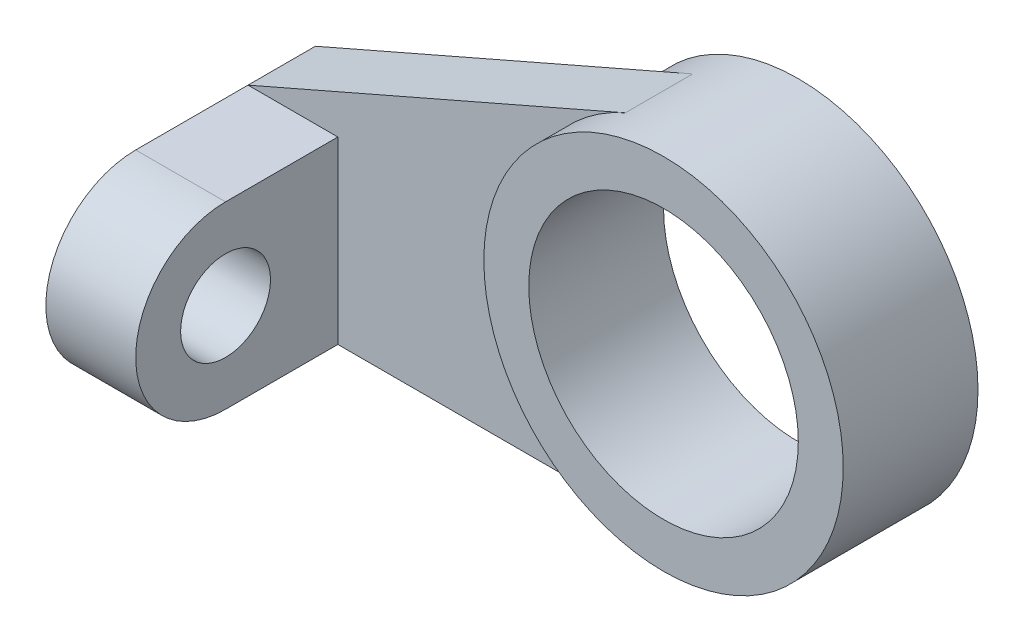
ISO-10303-21;
HEADER;
FILE_DESCRIPTION(('STEP AP214'),'2;1');
FILE_NAME('part.step','',(''),(''),'','','');
FILE_SCHEMA(('AUTOMOTIVE_DESIGN { 1 0 10303 214 1 1 1 1 }'));
ENDSEC;
DATA;
#1=APPLICATION_CONTEXT('core data for automotive mechanical design processes');
#2=APPLICATION_PROTOCOL_DEFINITION('international standard','automotive_design',2000,#1);
#3=PRODUCT_CONTEXT('',#1,'mechanical');
#4=PRODUCT('Part','Part','',(#3));
#5=PRODUCT_RELATED_PRODUCT_CATEGORY('part','',(#4));
#6=PRODUCT_DEFINITION_FORMATION('','',#4);
#7=PRODUCT_DEFINITION_CONTEXT('part definition',#1,'design');
#8=PRODUCT_DEFINITION('design','',#6,#7);
#9=PRODUCT_DEFINITION_SHAPE('','',#8);
#10=(LENGTH_UNIT() NAMED_UNIT(*) SI_UNIT(.MILLI.,.METRE.));
#11=(NAMED_UNIT(*) PLANE_ANGLE_UNIT() SI_UNIT($,.RADIAN.));
#12=(NAMED_UNIT(*) SI_UNIT($,.STERADIAN.) SOLID_ANGLE_UNIT());
#13=UNCERTAINTY_MEASURE_WITH_UNIT(LENGTH_MEASURE(1.E-05),#10,'distance_accuracy_value','');
#14=(GEOMETRIC_REPRESENTATION_CONTEXT(3) GLOBAL_UNCERTAINTY_ASSIGNED_CONTEXT((#13)) GLOBAL_UNIT_ASSIGNED_CONTEXT((#10,
#11,#12)) REPRESENTATION_CONTEXT('',''));
#15=CARTESIAN_POINT('',(0.,0.,0.));
#16=DIRECTION('',(0.,0.,1.));
#17=DIRECTION('',(1.,0.,0.));
#18=AXIS2_PLACEMENT_3D('',#15,#16,#17);
#19=CARTESIAN_POINT('',(0.,0.,19.05));
#20=DIRECTION('',(0.,0.,1.));
#21=DIRECTION('',(1.,0.,0.));
#22=AXIS2_PLACEMENT_3D('',#19,#20,#21);
#23=PLANE('',#22);
#24=CARTESIAN_POINT('',(0.,0.,19.05));
#25=DIRECTION('',(0.,0.,1.));
#26=DIRECTION('',(1.,0.,0.));
#27=AXIS2_PLACEMENT_3D('',#24,#25,#26);
#28=CIRCLE('',#27,50.8);
#29=CARTESIAN_POINT('',(50.8,0.,19.05));
#30=VERTEX_POINT('',#29);
#31=EDGE_CURVE('E12',#30,#30,#28,.T.);
#32=ORIENTED_EDGE('',*,*,#31,.T.);
#33=EDGE_LOOP('',(#32));
#34=FACE_BOUND('',#33,.T.);
#35=CARTESIAN_POINT('',(0.,0.,19.05));
#36=DIRECTION('',(0.,0.,1.));
#37=DIRECTION('',(1.,0.,0.));
#38=AXIS2_PLACEMENT_3D('',#35,#36,#37);
#39=CIRCLE('',#38,38.1);
#40=CARTESIAN_POINT('',(-38.1,0.,19.05));
#41=VERTEX_POINT('',#40);
#42=EDGE_CURVE('E158',#41,#41,#39,.T.);
#43=ORIENTED_EDGE('',*,*,#42,.F.);
#44=EDGE_LOOP('',(#43));
#45=FACE_BOUND('',#44,.T.);
#46=ADVANCED_FACE('F43',(#34,#45),#23,.T.);
#47=CARTESIAN_POINT('',(0.,0.,-19.05));
#48=DIRECTION('',(0.,0.,1.));
#49=DIRECTION('',(1.,0.,0.));
#50=AXIS2_PLACEMENT_3D('',#47,#48,#49);
#51=PLANE('',#50);
#52=CARTESIAN_POINT('',(0.,0.,-19.05));
#53=DIRECTION('',(0.,0.,1.));
#54=DIRECTION('',(1.,0.,0.));
#55=AXIS2_PLACEMENT_3D('',#52,#53,#54);
#56=CIRCLE('',#55,50.8);
#57=CARTESIAN_POINT('',(50.8,0.,-19.05));
#58=VERTEX_POINT('',#57);
#59=EDGE_CURVE('E47',#58,#58,#56,.T.);
#60=ORIENTED_EDGE('',*,*,#59,.F.);
#61=EDGE_LOOP('',(#60));
#62=FACE_BOUND('',#61,.T.);
#63=CARTESIAN_POINT('',(0.,0.,-19.05));
#64=DIRECTION('',(0.,0.,1.));
#65=DIRECTION('',(1.,0.,0.));
#66=AXIS2_PLACEMENT_3D('',#63,#64,#65);
#67=CIRCLE('',#66,38.1);
#68=CARTESIAN_POINT('',(-38.1,0.,-19.05));
#69=VERTEX_POINT('',#68);
#70=EDGE_CURVE('E157',#69,#69,#67,.T.);
#71=ORIENTED_EDGE('',*,*,#70,.T.);
#72=EDGE_LOOP('',(#71));
#73=FACE_BOUND('',#72,.T.);
#74=ADVANCED_FACE('F164',(#62,#73),#51,.F.);
#75=CARTESIAN_POINT('',(0.,0.,19.05));
#76=DIRECTION('',(0.,0.,-1.));
#77=DIRECTION('',(-1.,0.,0.));
#78=AXIS2_PLACEMENT_3D('',#75,#76,#77);
#79=CYLINDRICAL_SURFACE('',#78,50.8);
#80=DIRECTION('',(0.,0.,-1.));
#81=VECTOR('',#80,1.);
#82=CARTESIAN_POINT('',(-20.32,46.5589690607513,9.525));
#83=LINE('',#82,#81);
#84=CARTESIAN_POINT('',(-20.32,46.5589690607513,9.525));
#85=VERTEX_POINT('',#84);
#86=CARTESIAN_POINT('',(-20.32,46.5589690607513,-9.525));
#87=VERTEX_POINT('',#86);
#88=EDGE_CURVE('E154',#85,#87,#83,.T.);
#89=ORIENTED_EDGE('',*,*,#88,.F.);
#90=CARTESIAN_POINT('',(0.,0.,9.525));
#91=DIRECTION('',(0.,0.,-1.));
#92=DIRECTION('',(1.,0.,0.));
#93=AXIS2_PLACEMENT_3D('',#90,#91,#92);
#94=CIRCLE('',#93,50.8);
#95=CARTESIAN_POINT('',(0.,-50.8,9.525));
#96=VERTEX_POINT('',#95);
#97=EDGE_CURVE('E134',#96,#85,#94,.T.);
#98=ORIENTED_EDGE('',*,*,#97,.F.);
#99=DIRECTION('',(0.,0.,-1.));
#100=VECTOR('',#99,1.);
#101=CARTESIAN_POINT('',(0.,-50.8,9.525));
#102=LINE('',#101,#100);
#103=CARTESIAN_POINT('',(0.,-50.8,-9.525));
#104=VERTEX_POINT('',#103);
#105=EDGE_CURVE('E141',#96,#104,#102,.T.);
#106=ORIENTED_EDGE('',*,*,#105,.T.);
#107=CARTESIAN_POINT('',(0.,0.,-9.525));
#108=DIRECTION('',(0.,0.,-1.));
#109=DIRECTION('',(1.,0.,0.));
#110=AXIS2_PLACEMENT_3D('',#107,#108,#109);
#111=CIRCLE('',#110,50.8);
#112=EDGE_CURVE('E132',#104,#87,#111,.T.);
#113=ORIENTED_EDGE('',*,*,#112,.T.);
#114=EDGE_LOOP('',(#89,#98,#106,#113));
#115=FACE_BOUND('',#114,.T.);
#116=ORIENTED_EDGE('',*,*,#31,.F.);
#117=EDGE_LOOP('',(#116));
#118=FACE_BOUND('',#117,.T.);
#119=ORIENTED_EDGE('',*,*,#59,.T.);
#120=EDGE_LOOP('',(#119));
#121=FACE_BOUND('',#120,.T.);
#122=ADVANCED_FACE('F45',(#115,#118,#121),#79,.T.);
#123=CARTESIAN_POINT('',(0.,0.,19.05));
#124=DIRECTION('',(0.,0.,-1.));
#125=DIRECTION('',(-1.,0.,0.));
#126=AXIS2_PLACEMENT_3D('',#123,#124,#125);
#127=CYLINDRICAL_SURFACE('',#126,38.1);
#128=CARTESIAN_POINT('',(-38.1,0.,19.05));
#129=CARTESIAN_POINT('',(-38.1,0.,18.653125));
#130=CARTESIAN_POINT('',(-38.1,0.,18.25625));
#131=CARTESIAN_POINT('',(-38.1,0.,17.4625));
#132=CARTESIAN_POINT('',(-38.1,0.,17.065625));
#133=CARTESIAN_POINT('',(-38.1,0.,16.271875));
#134=CARTESIAN_POINT('',(-38.1,0.,15.875));
#135=CARTESIAN_POINT('',(-38.1,0.,15.08125));
#136=CARTESIAN_POINT('',(-38.1,0.,14.684375));
#137=CARTESIAN_POINT('',(-38.1,0.,13.890625));
#138=CARTESIAN_POINT('',(-38.1,0.,13.49375));
#139=CARTESIAN_POINT('',(-38.1,0.,12.7));
#140=CARTESIAN_POINT('',(-38.1,0.,12.303125));
#141=CARTESIAN_POINT('',(-38.1,0.,11.509375));
#142=CARTESIAN_POINT('',(-38.1,0.,11.1125));
#143=CARTESIAN_POINT('',(-38.1,0.,10.31875));
#144=CARTESIAN_POINT('',(-38.1,0.,9.921875));
#145=CARTESIAN_POINT('',(-38.1,0.,9.128125));
#146=CARTESIAN_POINT('',(-38.1,0.,8.73125));
#147=CARTESIAN_POINT('',(-38.1,0.,7.9375));
#148=CARTESIAN_POINT('',(-38.1,0.,7.540625));
#149=CARTESIAN_POINT('',(-38.1,0.,6.746875));
#150=CARTESIAN_POINT('',(-38.1,0.,6.35));
#151=CARTESIAN_POINT('',(-38.1,0.,5.55625));
#152=CARTESIAN_POINT('',(-38.1,0.,5.159375));
#153=CARTESIAN_POINT('',(-38.1,0.,4.365625));
#154=CARTESIAN_POINT('',(-38.1,0.,3.96875));
#155=CARTESIAN_POINT('',(-38.1,0.,3.175));
#156=CARTESIAN_POINT('',(-38.1,0.,2.778125));
#157=CARTESIAN_POINT('',(-38.1,0.,1.984375));
#158=CARTESIAN_POINT('',(-38.1,0.,1.5875));
#159=CARTESIAN_POINT('',(-38.1,0.,0.79375));
#160=CARTESIAN_POINT('',(-38.1,0.,0.396875));
#161=CARTESIAN_POINT('',(-38.1,0.,-0.396875));
#162=CARTESIAN_POINT('',(-38.1,0.,-0.79375));
#163=CARTESIAN_POINT('',(-38.1,0.,-1.5875));
#164=CARTESIAN_POINT('',(-38.1,0.,-1.984375));
#165=CARTESIAN_POINT('',(-38.1,0.,-2.778125));
#166=CARTESIAN_POINT('',(-38.1,0.,-3.175));
#167=CARTESIAN_POINT('',(-38.1,0.,-3.96875));
#168=CARTESIAN_POINT('',(-38.1,0.,-4.365625));
#169=CARTESIAN_POINT('',(-38.1,0.,-5.159375));
#170=CARTESIAN_POINT('',(-38.1,0.,-5.55625));
#171=CARTESIAN_POINT('',(-38.1,0.,-6.35));
#172=CARTESIAN_POINT('',(-38.1,0.,-6.746875));
#173=CARTESIAN_POINT('',(-38.1,0.,-7.540625));
#174=CARTESIAN_POINT('',(-38.1,0.,-7.9375));
#175=CARTESIAN_POINT('',(-38.1,0.,-8.73125));
#176=CARTESIAN_POINT('',(-38.1,0.,-9.128125));
#177=CARTESIAN_POINT('',(-38.1,0.,-9.921875));
#178=CARTESIAN_POINT('',(-38.1,0.,-10.31875));
#179=CARTESIAN_POINT('',(-38.1,0.,-11.1125));
#180=CARTESIAN_POINT('',(-38.1,0.,-11.509375));
#181=CARTESIAN_POINT('',(-38.1,0.,-12.303125));
#182=CARTESIAN_POINT('',(-38.1,0.,-12.7));
#183=CARTESIAN_POINT('',(-38.1,0.,-13.49375));
#184=CARTESIAN_POINT('',(-38.1,0.,-13.890625));
#185=CARTESIAN_POINT('',(-38.1,0.,-14.684375));
#186=CARTESIAN_POINT('',(-38.1,0.,-15.08125));
#187=CARTESIAN_POINT('',(-38.1,0.,-15.875));
#188=CARTESIAN_POINT('',(-38.1,0.,-16.271875));
#189=CARTESIAN_POINT('',(-38.1,0.,-17.065625));
#190=CARTESIAN_POINT('',(-38.1,0.,-17.4625));
#191=CARTESIAN_POINT('',(-38.1,0.,-18.25625));
#192=CARTESIAN_POINT('',(-38.1,0.,-18.653125));
#193=CARTESIAN_POINT('',(-38.1,0.,-19.05));
#194=B_SPLINE_CURVE_WITH_KNOTS('',3,(#128,#129,#130,#131,#132,#133,#134,#135,#136,#137,#138,
#139,#140,#141,#142,#143,#144,#145,#146,#147,#148,#149,#150,#151,#152,#153,#154,#155,#156,#157,
#158,#159,#160,#161,#162,#163,#164,#165,#166,#167,#168,#169,#170,#171,#172,#173,#174,#175,#176,
#177,#178,#179,#180,#181,#182,#183,#184,#185,#186,#187,#188,#189,#190,#191,#192,#193),
.UNSPECIFIED.,.F.,.F.,(4,2,2,2,2,2,2,2,2,2,2,2,2,2,2,2,2,2,2,2,2,2,2,2,2,2,2,2,2,2,2,2,4),(0.,
1.190625,2.38125,3.571875,4.7625,5.953125,7.14375,8.334375,9.525,10.715625,11.90625,13.096875,
14.2875,15.478125,16.66875,17.859375,19.05,20.240625,21.43125,22.621875,23.8125,25.003125,
26.19375,27.384375,28.575,29.765625,30.95625,32.146875,33.3375,34.528125,35.71875,36.909375,
38.1),.UNSPECIFIED.);
#195=EDGE_CURVE('BSEAM166',#41,#69,#194,.T.);
#196=ORIENTED_EDGE('',*,*,#42,.T.);
#197=ORIENTED_EDGE('',*,*,#70,.F.);
#198=ORIENTED_EDGE('',*,*,#195,.T.);
#199=ORIENTED_EDGE('',*,*,#195,.F.);
#200=EDGE_LOOP('',(#196,#198,#197,#199));
#201=FACE_BOUND('',#200,.T.);
#202=ADVANCED_FACE('F166',(#201),#127,.F.);
#203=CARTESIAN_POINT('',(-127.,0.,9.525));
#204=DIRECTION('',(0.4,-0.916515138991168,0.));
#205=DIRECTION('',(0.916515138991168,0.4,0.));
#206=AXIS2_PLACEMENT_3D('',#203,#204,#205);
#207=PLANE('',#206);
#208=DIRECTION('',(-0.916515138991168,-0.4,0.));
#209=VECTOR('',#208,1.);
#210=CARTESIAN_POINT('',(-127.,0.,-9.525));
#211=LINE('',#210,#209);
#212=CARTESIAN_POINT('',(-127.,0.,-9.525));
#213=VERTEX_POINT('',#212);
#214=EDGE_CURVE('E143',#87,#213,#211,.T.);
#215=ORIENTED_EDGE('',*,*,#214,.T.);
#216=DIRECTION('',(0.,0.,-1.));
#217=VECTOR('',#216,1.);
#218=CARTESIAN_POINT('',(-127.,0.,9.525));
#219=LINE('',#218,#217);
#220=CARTESIAN_POINT('',(-127.,0.,9.525));
#221=VERTEX_POINT('',#220);
#222=EDGE_CURVE('E151',#221,#213,#219,.T.);
#223=ORIENTED_EDGE('',*,*,#222,.F.);
#224=DIRECTION('',(-0.916515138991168,-0.4,0.));
#225=VECTOR('',#224,1.);
#226=CARTESIAN_POINT('',(-127.,0.,9.525));
#227=LINE('',#226,#225);
#228=EDGE_CURVE('E137',#85,#221,#227,.T.);
#229=ORIENTED_EDGE('',*,*,#228,.F.);
#230=ORIENTED_EDGE('',*,*,#88,.T.);
#231=EDGE_LOOP('',(#215,#223,#229,#230));
#232=FACE_BOUND('',#231,.T.);
#233=ADVANCED_FACE('F168',(#232),#207,.F.);
#234=CARTESIAN_POINT('',(-127.,-50.8,9.525));
#235=DIRECTION('',(1.,0.,0.));
#236=DIRECTION('',(0.,0.,-1.));
#237=AXIS2_PLACEMENT_3D('',#234,#235,#236);
#238=PLANE('',#237);
#239=DIRECTION('',(0.,-1.,0.));
#240=VECTOR('',#239,1.);
#241=CARTESIAN_POINT('',(-127.,-50.8,-9.525));
#242=LINE('',#241,#240);
#243=CARTESIAN_POINT('',(-127.,-50.8,-9.525));
#244=VERTEX_POINT('',#243);
#245=EDGE_CURVE('E145',#213,#244,#242,.T.);
#246=ORIENTED_EDGE('',*,*,#245,.T.);
#247=DIRECTION('',(0.,0.,-1.));
#248=VECTOR('',#247,1.);
#249=CARTESIAN_POINT('',(-127.,-50.8,9.525));
#250=LINE('',#249,#248);
#251=CARTESIAN_POINT('',(-127.,-50.8,41.275));
#252=VERTEX_POINT('',#251);
#253=EDGE_CURVE('E149',#252,#244,#250,.T.);
#254=ORIENTED_EDGE('',*,*,#253,.F.);
#255=CARTESIAN_POINT('',(-127.,-25.4,41.275));
#256=DIRECTION('',(-1.,0.,0.));
#257=DIRECTION('',(0.,0.,1.));
#258=AXIS2_PLACEMENT_3D('',#255,#256,#257);
#259=CIRCLE('',#258,25.4);
#260=CARTESIAN_POINT('',(-127.,0.,41.275));
#261=VERTEX_POINT('',#260);
#262=EDGE_CURVE('E104',#252,#261,#259,.T.);
#263=ORIENTED_EDGE('',*,*,#262,.T.);
#264=DIRECTION('',(0.,0.,-1.));
#265=VECTOR('',#264,1.);
#266=CARTESIAN_POINT('',(-127.,0.,9.525));
#267=LINE('',#266,#265);
#268=EDGE_CURVE('E122',#261,#221,#267,.T.);
#269=ORIENTED_EDGE('',*,*,#268,.T.);
#270=ORIENTED_EDGE('',*,*,#222,.T.);
#271=EDGE_LOOP('',(#246,#254,#263,#269,#270));
#272=FACE_BOUND('',#271,.T.);
#273=CARTESIAN_POINT('',(-127.,-25.4,41.275));
#274=DIRECTION('',(-1.,0.,0.));
#275=DIRECTION('',(0.,0.,1.));
#276=AXIS2_PLACEMENT_3D('',#273,#274,#275);
#277=CIRCLE('',#276,12.7);
#278=CARTESIAN_POINT('',(-127.,-25.4,53.975));
#279=VERTEX_POINT('',#278);
#280=EDGE_CURVE('E291',#279,#279,#277,.T.);
#281=ORIENTED_EDGE('',*,*,#280,.F.);
#282=EDGE_LOOP('',(#281));
#283=FACE_BOUND('',#282,.T.);
#284=ADVANCED_FACE('F175',(#272,#283),#238,.F.);
#285=CARTESIAN_POINT('',(0.,-50.8,9.525));
#286=DIRECTION('',(0.,1.,0.));
#287=DIRECTION('',(-1.,0.,0.));
#288=AXIS2_PLACEMENT_3D('',#285,#286,#287);
#289=PLANE('',#288);
#290=DIRECTION('',(1.,0.,0.));
#291=VECTOR('',#290,1.);
#292=CARTESIAN_POINT('',(0.,-50.8,-9.525));
#293=LINE('',#292,#291);
#294=EDGE_CURVE('E138',#244,#104,#293,.T.);
#295=ORIENTED_EDGE('',*,*,#294,.T.);
#296=ORIENTED_EDGE('',*,*,#105,.F.);
#297=DIRECTION('',(1.,0.,0.));
#298=VECTOR('',#297,1.);
#299=CARTESIAN_POINT('',(0.,-50.8,9.525));
#300=LINE('',#299,#298);
#301=CARTESIAN_POINT('',(-101.6,-50.8,9.525));
#302=VERTEX_POINT('',#301);
#303=EDGE_CURVE('E120',#302,#96,#300,.T.);
#304=ORIENTED_EDGE('',*,*,#303,.F.);
#305=DIRECTION('',(0.,0.,1.));
#306=VECTOR('',#305,1.);
#307=CARTESIAN_POINT('',(-101.6,-50.8,9.525));
#308=LINE('',#307,#306);
#309=CARTESIAN_POINT('',(-101.6,-50.8,41.275));
#310=VERTEX_POINT('',#309);
#311=EDGE_CURVE('E114',#302,#310,#308,.T.);
#312=ORIENTED_EDGE('',*,*,#311,.T.);
#313=DIRECTION('',(-1.,0.,0.));
#314=VECTOR('',#313,1.);
#315=CARTESIAN_POINT('',(-101.6,-50.8,41.275));
#316=LINE('',#315,#314);
#317=EDGE_CURVE('E98',#310,#252,#316,.T.);
#318=ORIENTED_EDGE('',*,*,#317,.T.);
#319=ORIENTED_EDGE('',*,*,#253,.T.);
#320=EDGE_LOOP('',(#295,#296,#304,#312,#318,#319));
#321=FACE_BOUND('',#320,.T.);
#322=ADVANCED_FACE('F118',(#321),#289,.F.);
#323=CARTESIAN_POINT('',(0.,0.,9.525));
#324=DIRECTION('',(0.,0.,1.));
#325=DIRECTION('',(1.,0.,0.));
#326=AXIS2_PLACEMENT_3D('',#323,#324,#325);
#327=PLANE('',#326);
#328=DIRECTION('',(-1.,0.,0.));
#329=VECTOR('',#328,1.);
#330=CARTESIAN_POINT('',(-101.6,0.,9.525));
#331=LINE('',#330,#329);
#332=CARTESIAN_POINT('',(-101.6,0.,9.525));
#333=VERTEX_POINT('',#332);
#334=EDGE_CURVE('E58',#333,#221,#331,.T.);
#335=ORIENTED_EDGE('',*,*,#334,.F.);
#336=DIRECTION('',(0.,-1.,0.));
#337=VECTOR('',#336,1.);
#338=CARTESIAN_POINT('',(-101.6,0.,9.525));
#339=LINE('',#338,#337);
#340=EDGE_CURVE('E62',#333,#302,#339,.T.);
#341=ORIENTED_EDGE('',*,*,#340,.T.);
#342=ORIENTED_EDGE('',*,*,#303,.T.);
#343=ORIENTED_EDGE('',*,*,#97,.T.);
#344=ORIENTED_EDGE('',*,*,#228,.T.);
#345=EDGE_LOOP('',(#335,#341,#342,#343,#344));
#346=FACE_BOUND('',#345,.T.);
#347=ADVANCED_FACE('F212',(#346),#327,.T.);
#348=CARTESIAN_POINT('',(0.,0.,-9.525));
#349=DIRECTION('',(0.,0.,1.));
#350=DIRECTION('',(1.,0.,0.));
#351=AXIS2_PLACEMENT_3D('',#348,#349,#350);
#352=PLANE('',#351);
#353=ORIENTED_EDGE('',*,*,#112,.F.);
#354=ORIENTED_EDGE('',*,*,#294,.F.);
#355=ORIENTED_EDGE('',*,*,#245,.F.);
#356=ORIENTED_EDGE('',*,*,#214,.F.);
#357=EDGE_LOOP('',(#353,#354,#355,#356));
#358=FACE_BOUND('',#357,.T.);
#359=ADVANCED_FACE('F206',(#358),#352,.F.);
#360=CARTESIAN_POINT('',(-101.6,0.,9.525));
#361=DIRECTION('',(0.,1.,0.));
#362=DIRECTION('',(0.,0.,1.));
#363=AXIS2_PLACEMENT_3D('',#360,#361,#362);
#364=PLANE('',#363);
#365=ORIENTED_EDGE('',*,*,#268,.F.);
#366=DIRECTION('',(-1.,0.,0.));
#367=VECTOR('',#366,1.);
#368=CARTESIAN_POINT('',(-101.6,0.,41.275));
#369=LINE('',#368,#367);
#370=CARTESIAN_POINT('',(-101.6,0.,41.275));
#371=VERTEX_POINT('',#370);
#372=EDGE_CURVE('E108',#371,#261,#369,.T.);
#373=ORIENTED_EDGE('',*,*,#372,.F.);
#374=DIRECTION('',(0.,0.,-1.));
#375=VECTOR('',#374,1.);
#376=CARTESIAN_POINT('',(-101.6,0.,9.525));
#377=LINE('',#376,#375);
#378=EDGE_CURVE('E109',#371,#333,#377,.T.);
#379=ORIENTED_EDGE('',*,*,#378,.T.);
#380=ORIENTED_EDGE('',*,*,#334,.T.);
#381=EDGE_LOOP('',(#365,#373,#379,#380));
#382=FACE_BOUND('',#381,.T.);
#383=ADVANCED_FACE('F211',(#382),#364,.T.);
#384=CARTESIAN_POINT('',(-101.6,-25.4,41.275));
#385=DIRECTION('',(-1.,0.,0.));
#386=DIRECTION('',(0.,0.,1.));
#387=AXIS2_PLACEMENT_3D('',#384,#385,#386);
#388=CYLINDRICAL_SURFACE('',#387,25.4);
#389=ORIENTED_EDGE('',*,*,#262,.F.);
#390=ORIENTED_EDGE('',*,*,#317,.F.);
#391=CARTESIAN_POINT('',(-101.6,-25.4,41.275));
#392=DIRECTION('',(-1.,0.,0.));
#393=DIRECTION('',(0.,0.,1.));
#394=AXIS2_PLACEMENT_3D('',#391,#392,#393);
#395=CIRCLE('',#394,25.4);
#396=EDGE_CURVE('E101',#310,#371,#395,.T.);
#397=ORIENTED_EDGE('',*,*,#396,.T.);
#398=ORIENTED_EDGE('',*,*,#372,.T.);
#399=EDGE_LOOP('',(#389,#390,#397,#398));
#400=FACE_BOUND('',#399,.T.);
#401=ADVANCED_FACE('F100',(#400),#388,.T.);
#402=CARTESIAN_POINT('',(-101.6,-25.4,41.275));
#403=DIRECTION('',(-1.,0.,0.));
#404=DIRECTION('',(0.,0.,1.));
#405=AXIS2_PLACEMENT_3D('',#402,#403,#404);
#406=PLANE('',#405);
#407=CARTESIAN_POINT('',(-101.6,-25.4,41.275));
#408=DIRECTION('',(-1.,0.,0.));
#409=DIRECTION('',(0.,0.,1.));
#410=AXIS2_PLACEMENT_3D('',#407,#408,#409);
#411=CIRCLE('',#410,12.7);
#412=CARTESIAN_POINT('',(-101.6,-25.4,53.975));
#413=VERTEX_POINT('',#412);
#414=EDGE_CURVE('E128',#413,#413,#411,.T.);
#415=ORIENTED_EDGE('',*,*,#414,.T.);
#416=EDGE_LOOP('',(#415));
#417=FACE_BOUND('',#416,.T.);
#418=ORIENTED_EDGE('',*,*,#340,.F.);
#419=ORIENTED_EDGE('',*,*,#378,.F.);
#420=ORIENTED_EDGE('',*,*,#396,.F.);
#421=ORIENTED_EDGE('',*,*,#311,.F.);
#422=EDGE_LOOP('',(#418,#419,#420,#421));
#423=FACE_BOUND('',#422,.T.);
#424=ADVANCED_FACE('F113',(#417,#423),#406,.F.);
#425=CARTESIAN_POINT('',(-101.6,-25.4,41.275));
#426=DIRECTION('',(-1.,0.,0.));
#427=DIRECTION('',(0.,0.,1.));
#428=AXIS2_PLACEMENT_3D('',#425,#426,#427);
#429=CYLINDRICAL_SURFACE('',#428,12.7);
#430=ORIENTED_EDGE('',*,*,#414,.F.);
#431=EDGE_LOOP('',(#430));
#432=FACE_BOUND('',#431,.T.);
#433=ORIENTED_EDGE('',*,*,#280,.T.);
#434=EDGE_LOOP('',(#433));
#435=FACE_BOUND('',#434,.T.);
#436=ADVANCED_FACE('F272',(#432,#435),#429,.F.);
#437=CLOSED_SHELL('',(#46,#74,#122,#202,#233,#284,#322,#347,#359,#383,#401,#424,#436));
#438=MANIFOLD_SOLID_BREP('B2',#437);
#439=ADVANCED_BREP_SHAPE_REPRESENTATION('',(#18,#438),#14);
#440=SHAPE_DEFINITION_REPRESENTATION(#9,#439);
ENDSEC;
END-ISO-10303-21;
